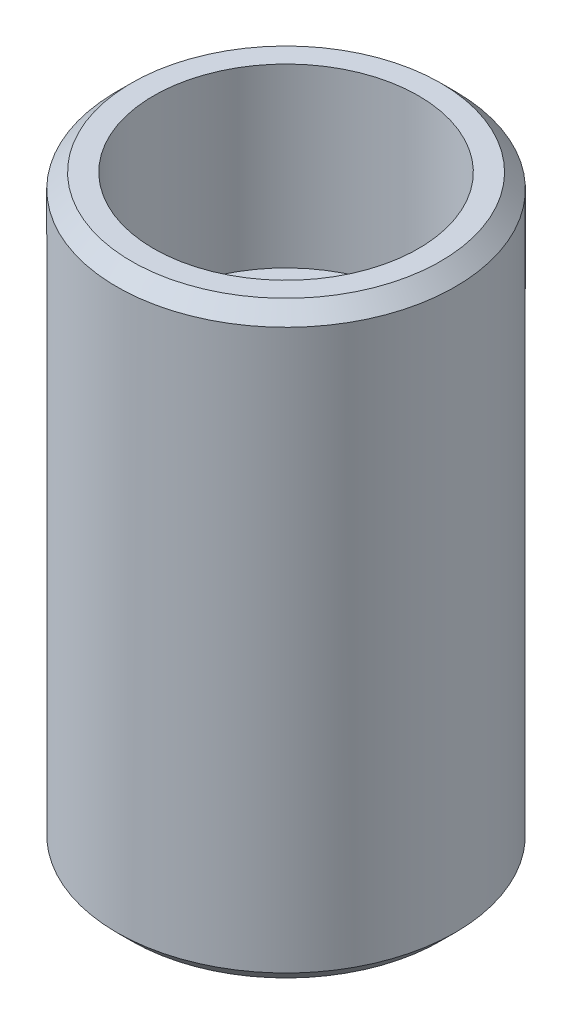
ISO-10303-21;
HEADER;
FILE_DESCRIPTION(('STEP AP214'),'2;1');
FILE_NAME('part.step','',(''),(''),'','','');
FILE_SCHEMA(('AUTOMOTIVE_DESIGN { 1 0 10303 214 1 1 1 1 }'));
ENDSEC;
DATA;
#1=APPLICATION_CONTEXT('core data for automotive mechanical design processes');
#2=APPLICATION_PROTOCOL_DEFINITION('international standard','automotive_design',2000,#1);
#3=PRODUCT_CONTEXT('',#1,'mechanical');
#4=PRODUCT('Part','Part','',(#3));
#5=PRODUCT_RELATED_PRODUCT_CATEGORY('part','',(#4));
#6=PRODUCT_DEFINITION_FORMATION('','',#4);
#7=PRODUCT_DEFINITION_CONTEXT('part definition',#1,'design');
#8=PRODUCT_DEFINITION('design','',#6,#7);
#9=PRODUCT_DEFINITION_SHAPE('','',#8);
#10=(LENGTH_UNIT() NAMED_UNIT(*) SI_UNIT(.MILLI.,.METRE.));
#11=(NAMED_UNIT(*) PLANE_ANGLE_UNIT() SI_UNIT($,.RADIAN.));
#12=(NAMED_UNIT(*) SI_UNIT($,.STERADIAN.) SOLID_ANGLE_UNIT());
#13=UNCERTAINTY_MEASURE_WITH_UNIT(LENGTH_MEASURE(1.E-05),#10,'distance_accuracy_value','');
#14=(GEOMETRIC_REPRESENTATION_CONTEXT(3) GLOBAL_UNCERTAINTY_ASSIGNED_CONTEXT((#13)) GLOBAL_UNIT_ASSIGNED_CONTEXT((#10,
#11,#12)) REPRESENTATION_CONTEXT('',''));
#15=CARTESIAN_POINT('',(0.,0.,0.));
#16=DIRECTION('',(0.,0.,1.));
#17=DIRECTION('',(1.,0.,0.));
#18=AXIS2_PLACEMENT_3D('',#15,#16,#17);
#19=CARTESIAN_POINT('',(0.,0.,0.));
#20=DIRECTION('',(0.,-1.,0.));
#21=DIRECTION('',(0.,0.,-1.));
#22=AXIS2_PLACEMENT_3D('',#19,#20,#21);
#23=CYLINDRICAL_SURFACE('',#22,5.75);
#24=CARTESIAN_POINT('',(0.,0.500000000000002,0.));
#25=DIRECTION('',(0.,1.,0.));
#26=DIRECTION('',(0.,0.,1.));
#27=AXIS2_PLACEMENT_3D('',#24,#25,#26);
#28=CIRCLE('',#27,5.75);
#29=CARTESIAN_POINT('',(0.,0.500000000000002,5.75));
#30=VERTEX_POINT('',#29);
#31=EDGE_CURVE('E36',#30,#30,#28,.T.);
#32=ORIENTED_EDGE('',*,*,#31,.T.);
#33=EDGE_LOOP('',(#32));
#34=FACE_BOUND('',#33,.T.);
#35=CARTESIAN_POINT('',(0.,19.5,0.));
#36=DIRECTION('',(0.,-1.,0.));
#37=DIRECTION('',(0.,0.,-1.));
#38=AXIS2_PLACEMENT_3D('',#35,#36,#37);
#39=CIRCLE('',#38,5.75);
#40=CARTESIAN_POINT('',(0.,19.5,-5.75));
#41=VERTEX_POINT('',#40);
#42=EDGE_CURVE('E40',#41,#41,#39,.T.);
#43=ORIENTED_EDGE('',*,*,#42,.T.);
#44=EDGE_LOOP('',(#43));
#45=FACE_BOUND('',#44,.T.);
#46=ADVANCED_FACE('F30',(#34,#45),#23,.T.);
#47=CARTESIAN_POINT('',(-5.75,0.,0.));
#48=DIRECTION('',(0.,1.,0.));
#49=DIRECTION('',(0.,0.,1.));
#50=AXIS2_PLACEMENT_3D('',#47,#48,#49);
#51=PLANE('',#50);
#52=CARTESIAN_POINT('',(0.,0.,0.));
#53=DIRECTION('',(0.,1.,0.));
#54=DIRECTION('',(0.,0.,1.));
#55=AXIS2_PLACEMENT_3D('',#52,#53,#54);
#56=CIRCLE('',#55,3.24999999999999);
#57=CARTESIAN_POINT('',(0.,0.,3.24999999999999));
#58=VERTEX_POINT('',#57);
#59=EDGE_CURVE('E44',#58,#58,#56,.T.);
#60=ORIENTED_EDGE('',*,*,#59,.T.);
#61=EDGE_LOOP('',(#60));
#62=FACE_BOUND('',#61,.T.);
#63=CARTESIAN_POINT('',(0.,0.,0.));
#64=DIRECTION('',(0.,1.,0.));
#65=DIRECTION('',(0.,0.,1.));
#66=AXIS2_PLACEMENT_3D('',#63,#64,#65);
#67=CIRCLE('',#66,5.25);
#68=CARTESIAN_POINT('',(0.,0.,5.25));
#69=VERTEX_POINT('',#68);
#70=EDGE_CURVE('E49',#69,#69,#67,.F.);
#71=ORIENTED_EDGE('',*,*,#70,.T.);
#72=EDGE_LOOP('',(#71));
#73=FACE_BOUND('',#72,.T.);
#74=ADVANCED_FACE('F81',(#62,#73),#51,.F.);
#75=CARTESIAN_POINT('',(0.,0.,0.));
#76=DIRECTION('',(0.,-1.,0.));
#77=DIRECTION('',(0.,0.,-1.));
#78=AXIS2_PLACEMENT_3D('',#75,#76,#77);
#79=CYLINDRICAL_SURFACE('',#78,2.75);
#80=CARTESIAN_POINT('',(0.,0.500000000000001,0.));
#81=DIRECTION('',(0.,1.,0.));
#82=DIRECTION('',(0.,0.,1.));
#83=AXIS2_PLACEMENT_3D('',#80,#81,#82);
#84=CIRCLE('',#83,2.75);
#85=CARTESIAN_POINT('',(0.,0.500000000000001,2.75));
#86=VERTEX_POINT('',#85);
#87=EDGE_CURVE('E52',#86,#86,#84,.F.);
#88=ORIENTED_EDGE('',*,*,#87,.T.);
#89=EDGE_LOOP('',(#88));
#90=FACE_BOUND('',#89,.T.);
#91=CARTESIAN_POINT('',(0.,14.,0.));
#92=DIRECTION('',(0.,-1.,0.));
#93=DIRECTION('',(0.,0.,-1.));
#94=AXIS2_PLACEMENT_3D('',#91,#92,#93);
#95=CIRCLE('',#94,2.75);
#96=CARTESIAN_POINT('',(0.,14.,-2.75));
#97=VERTEX_POINT('',#96);
#98=EDGE_CURVE('E55',#97,#97,#95,.T.);
#99=ORIENTED_EDGE('',*,*,#98,.F.);
#100=EDGE_LOOP('',(#99));
#101=FACE_BOUND('',#100,.T.);
#102=ADVANCED_FACE('F76',(#90,#101),#79,.F.);
#103=CARTESIAN_POINT('',(-4.5,14.,0.));
#104=DIRECTION('',(0.,-1.,0.));
#105=DIRECTION('',(0.,0.,-1.));
#106=AXIS2_PLACEMENT_3D('',#103,#104,#105);
#107=PLANE('',#106);
#108=CARTESIAN_POINT('',(0.,14.,0.));
#109=DIRECTION('',(0.,-1.,0.));
#110=DIRECTION('',(0.,0.,-1.));
#111=AXIS2_PLACEMENT_3D('',#108,#109,#110);
#112=CIRCLE('',#111,4.5);
#113=CARTESIAN_POINT('',(0.,14.,-4.5));
#114=VERTEX_POINT('',#113);
#115=EDGE_CURVE('E58',#114,#114,#112,.T.);
#116=ORIENTED_EDGE('',*,*,#115,.F.);
#117=EDGE_LOOP('',(#116));
#118=FACE_BOUND('',#117,.T.);
#119=ORIENTED_EDGE('',*,*,#98,.T.);
#120=EDGE_LOOP('',(#119));
#121=FACE_BOUND('',#120,.T.);
#122=ADVANCED_FACE('F70',(#118,#121),#107,.F.);
#123=CARTESIAN_POINT('',(0.,0.,0.));
#124=DIRECTION('',(0.,-1.,0.));
#125=DIRECTION('',(0.,0.,-1.));
#126=AXIS2_PLACEMENT_3D('',#123,#124,#125);
#127=CYLINDRICAL_SURFACE('',#126,4.5);
#128=CARTESIAN_POINT('',(0.,20.,0.));
#129=DIRECTION('',(0.,-1.,0.));
#130=DIRECTION('',(0.,0.,-1.));
#131=AXIS2_PLACEMENT_3D('',#128,#129,#130);
#132=CIRCLE('',#131,4.5);
#133=CARTESIAN_POINT('',(0.,20.,-4.5));
#134=VERTEX_POINT('',#133);
#135=EDGE_CURVE('E61',#134,#134,#132,.T.);
#136=ORIENTED_EDGE('',*,*,#135,.F.);
#137=EDGE_LOOP('',(#136));
#138=FACE_BOUND('',#137,.T.);
#139=ORIENTED_EDGE('',*,*,#115,.T.);
#140=EDGE_LOOP('',(#139));
#141=FACE_BOUND('',#140,.T.);
#142=ADVANCED_FACE('F67',(#138,#141),#127,.F.);
#143=CARTESIAN_POINT('',(-5.75,20.,0.));
#144=DIRECTION('',(0.,-1.,0.));
#145=DIRECTION('',(0.,0.,-1.));
#146=AXIS2_PLACEMENT_3D('',#143,#144,#145);
#147=PLANE('',#146);
#148=CARTESIAN_POINT('',(0.,20.,0.));
#149=DIRECTION('',(0.,-1.,0.));
#150=DIRECTION('',(0.,0.,-1.));
#151=AXIS2_PLACEMENT_3D('',#148,#149,#150);
#152=CIRCLE('',#151,5.24999999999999);
#153=CARTESIAN_POINT('',(0.,20.,-5.24999999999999));
#154=VERTEX_POINT('',#153);
#155=EDGE_CURVE('E10',#154,#154,#152,.F.);
#156=ORIENTED_EDGE('',*,*,#155,.T.);
#157=EDGE_LOOP('',(#156));
#158=FACE_BOUND('',#157,.T.);
#159=ORIENTED_EDGE('',*,*,#135,.T.);
#160=EDGE_LOOP('',(#159));
#161=FACE_BOUND('',#160,.T.);
#162=ADVANCED_FACE('F65',(#158,#161),#147,.F.);
#163=CARTESIAN_POINT('',(0.,0.500000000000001,0.));
#164=DIRECTION('',(0.,-1.,0.));
#165=DIRECTION('',(0.,0.,-1.));
#166=AXIS2_PLACEMENT_3D('',#163,#164,#165);
#167=CONICAL_SURFACE('',#166,2.75,0.785398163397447);
#168=ORIENTED_EDGE('',*,*,#59,.F.);
#169=EDGE_LOOP('',(#168));
#170=FACE_BOUND('',#169,.T.);
#171=ORIENTED_EDGE('',*,*,#87,.F.);
#172=EDGE_LOOP('',(#171));
#173=FACE_BOUND('',#172,.T.);
#174=ADVANCED_FACE('F102',(#170,#173),#167,.F.);
#175=CARTESIAN_POINT('',(0.,0.,0.));
#176=DIRECTION('',(0.,1.,0.));
#177=DIRECTION('',(0.,0.,1.));
#178=AXIS2_PLACEMENT_3D('',#175,#176,#177);
#179=CONICAL_SURFACE('',#178,5.25,0.785398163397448);
#180=ORIENTED_EDGE('',*,*,#31,.F.);
#181=EDGE_LOOP('',(#180));
#182=FACE_BOUND('',#181,.T.);
#183=ORIENTED_EDGE('',*,*,#70,.F.);
#184=EDGE_LOOP('',(#183));
#185=FACE_BOUND('',#184,.T.);
#186=ADVANCED_FACE('F96',(#182,#185),#179,.T.);
#187=CARTESIAN_POINT('',(0.,19.5,0.));
#188=DIRECTION('',(0.,-1.,0.));
#189=DIRECTION('',(0.,0.,-1.));
#190=AXIS2_PLACEMENT_3D('',#187,#188,#189);
#191=CONICAL_SURFACE('',#190,5.75,0.785398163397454);
#192=ORIENTED_EDGE('',*,*,#155,.F.);
#193=EDGE_LOOP('',(#192));
#194=FACE_BOUND('',#193,.T.);
#195=ORIENTED_EDGE('',*,*,#42,.F.);
#196=EDGE_LOOP('',(#195));
#197=FACE_BOUND('',#196,.T.);
#198=ADVANCED_FACE('F94',(#194,#197),#191,.T.);
#199=CLOSED_SHELL('',(#46,#74,#102,#122,#142,#162,#174,#186,#198));
#200=MANIFOLD_SOLID_BREP('B2',#199);
#201=ADVANCED_BREP_SHAPE_REPRESENTATION('',(#18,#200),#14);
#202=SHAPE_DEFINITION_REPRESENTATION(#9,#201);
ENDSEC;
END-ISO-10303-21;
